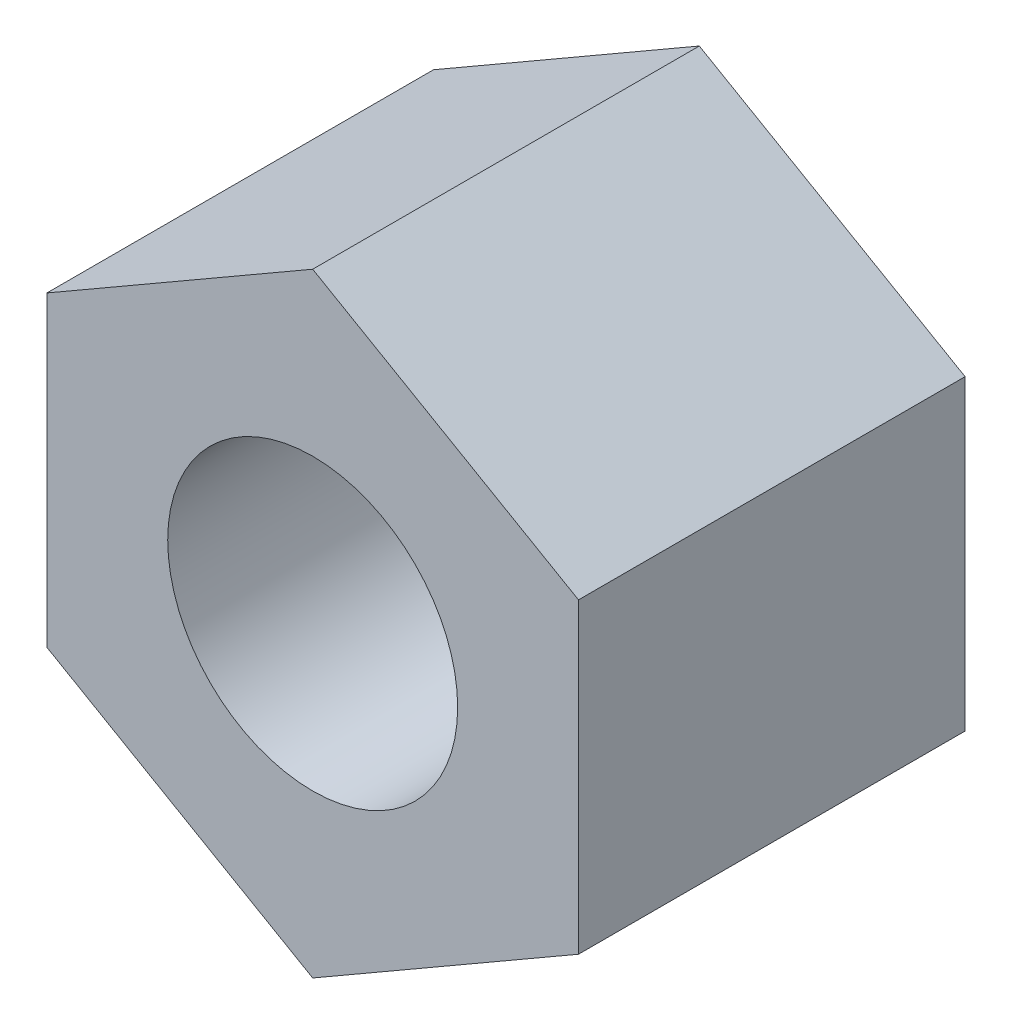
from build123d import *

# Parameters (mm, degrees)
SKETCH_1_R                   = 1.5
UNTHREADED_NOMINAL_NUT_DEPTH = 4


with BuildPart() as part:
    # Sketch 1 → Unthreaded_nominal_nut (new body)
    with BuildSketch(Plane.XY):
        Polygon((2.75, 1.58771324), (0, 3.175426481), (-2.75, 1.58771324), (-2.75, -1.58771324), (0, -3.175426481), (2.75, -1.58771324), align=None)
        Circle(SKETCH_1_R, mode=Mode.SUBTRACT)
    extrude(amount=UNTHREADED_NOMINAL_NUT_DEPTH)


solid = part.part
